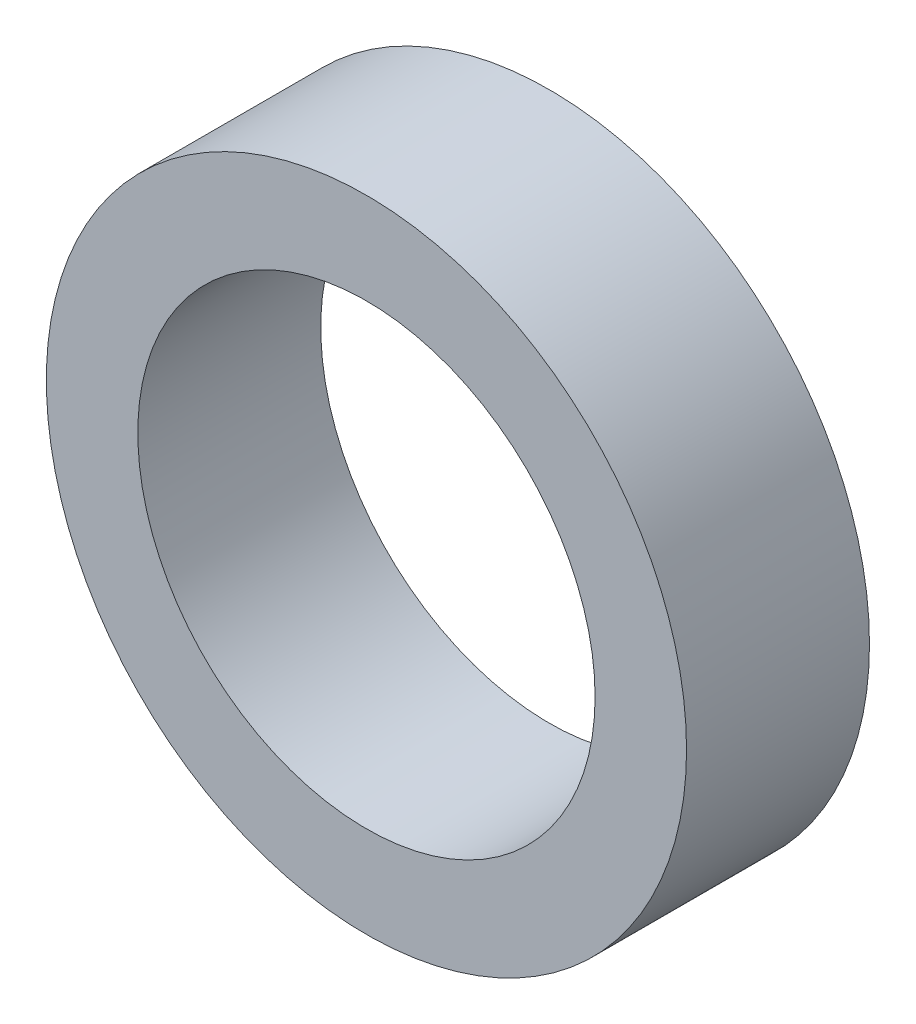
ISO-10303-21;
HEADER;
FILE_DESCRIPTION(('STEP AP214'),'2;1');
FILE_NAME('part.step','',(''),(''),'','','');
FILE_SCHEMA(('AUTOMOTIVE_DESIGN { 1 0 10303 214 1 1 1 1 }'));
ENDSEC;
DATA;
#1=APPLICATION_CONTEXT('core data for automotive mechanical design processes');
#2=APPLICATION_PROTOCOL_DEFINITION('international standard','automotive_design',2000,#1);
#3=PRODUCT_CONTEXT('',#1,'mechanical');
#4=PRODUCT('Part','Part','',(#3));
#5=PRODUCT_RELATED_PRODUCT_CATEGORY('part','',(#4));
#6=PRODUCT_DEFINITION_FORMATION('','',#4);
#7=PRODUCT_DEFINITION_CONTEXT('part definition',#1,'design');
#8=PRODUCT_DEFINITION('design','',#6,#7);
#9=PRODUCT_DEFINITION_SHAPE('','',#8);
#10=(LENGTH_UNIT() NAMED_UNIT(*) SI_UNIT(.MILLI.,.METRE.));
#11=(NAMED_UNIT(*) PLANE_ANGLE_UNIT() SI_UNIT($,.RADIAN.));
#12=(NAMED_UNIT(*) SI_UNIT($,.STERADIAN.) SOLID_ANGLE_UNIT());
#13=UNCERTAINTY_MEASURE_WITH_UNIT(LENGTH_MEASURE(1.E-05),#10,'distance_accuracy_value','');
#14=(GEOMETRIC_REPRESENTATION_CONTEXT(3) GLOBAL_UNCERTAINTY_ASSIGNED_CONTEXT((#13)) GLOBAL_UNIT_ASSIGNED_CONTEXT((#10,
#11,#12)) REPRESENTATION_CONTEXT('',''));
#15=CARTESIAN_POINT('',(0.,0.,0.));
#16=DIRECTION('',(0.,0.,1.));
#17=DIRECTION('',(1.,0.,0.));
#18=AXIS2_PLACEMENT_3D('',#15,#16,#17);
#19=CARTESIAN_POINT('',(0.,0.,4.));
#20=DIRECTION('',(0.,0.,-1.));
#21=DIRECTION('',(0.,1.,0.));
#22=AXIS2_PLACEMENT_3D('',#19,#20,#21);
#23=CYLINDRICAL_SURFACE('',#22,5.);
#24=CARTESIAN_POINT('',(0.,0.,4.));
#25=DIRECTION('',(0.,0.,-1.));
#26=DIRECTION('',(1.,0.,0.));
#27=AXIS2_PLACEMENT_3D('',#24,#25,#26);
#28=CIRCLE('',#27,5.);
#29=CARTESIAN_POINT('',(5.,0.,4.));
#30=VERTEX_POINT('',#29);
#31=EDGE_CURVE('E8',#30,#30,#28,.T.);
#32=ORIENTED_EDGE('',*,*,#31,.F.);
#33=EDGE_LOOP('',(#32));
#34=FACE_BOUND('',#33,.T.);
#35=CARTESIAN_POINT('',(0.,0.,0.));
#36=DIRECTION('',(0.,0.,-1.));
#37=DIRECTION('',(1.,0.,0.));
#38=AXIS2_PLACEMENT_3D('',#35,#36,#37);
#39=CIRCLE('',#38,5.);
#40=CARTESIAN_POINT('',(5.,0.,0.));
#41=VERTEX_POINT('',#40);
#42=EDGE_CURVE('E23',#41,#41,#39,.T.);
#43=ORIENTED_EDGE('',*,*,#42,.T.);
#44=EDGE_LOOP('',(#43));
#45=FACE_BOUND('',#44,.T.);
#46=ADVANCED_FACE('F12',(#34,#45),#23,.F.);
#47=CARTESIAN_POINT('',(0.,0.,4.));
#48=DIRECTION('',(0.,0.,-1.));
#49=DIRECTION('',(0.,1.,0.));
#50=AXIS2_PLACEMENT_3D('',#47,#48,#49);
#51=CYLINDRICAL_SURFACE('',#50,7.);
#52=CARTESIAN_POINT('',(0.,0.,4.));
#53=DIRECTION('',(0.,0.,-1.));
#54=DIRECTION('',(1.,0.,0.));
#55=AXIS2_PLACEMENT_3D('',#52,#53,#54);
#56=CIRCLE('',#55,7.);
#57=CARTESIAN_POINT('',(7.,0.,4.));
#58=VERTEX_POINT('',#57);
#59=EDGE_CURVE('E19',#58,#58,#56,.T.);
#60=ORIENTED_EDGE('',*,*,#59,.T.);
#61=EDGE_LOOP('',(#60));
#62=FACE_BOUND('',#61,.T.);
#63=CARTESIAN_POINT('',(0.,0.,0.));
#64=DIRECTION('',(0.,0.,-1.));
#65=DIRECTION('',(1.,0.,0.));
#66=AXIS2_PLACEMENT_3D('',#63,#64,#65);
#67=CIRCLE('',#66,7.);
#68=CARTESIAN_POINT('',(7.,0.,0.));
#69=VERTEX_POINT('',#68);
#70=EDGE_CURVE('E28',#69,#69,#67,.T.);
#71=ORIENTED_EDGE('',*,*,#70,.F.);
#72=EDGE_LOOP('',(#71));
#73=FACE_BOUND('',#72,.T.);
#74=ADVANCED_FACE('F14',(#62,#73),#51,.T.);
#75=CARTESIAN_POINT('',(0.,0.,4.));
#76=DIRECTION('',(0.,0.,-1.));
#77=DIRECTION('',(0.,1.,0.));
#78=AXIS2_PLACEMENT_3D('',#75,#76,#77);
#79=PLANE('',#78);
#80=ORIENTED_EDGE('',*,*,#31,.T.);
#81=EDGE_LOOP('',(#80));
#82=FACE_BOUND('',#81,.T.);
#83=ORIENTED_EDGE('',*,*,#59,.F.);
#84=EDGE_LOOP('',(#83));
#85=FACE_BOUND('',#84,.T.);
#86=ADVANCED_FACE('F40',(#82,#85),#79,.F.);
#87=CARTESIAN_POINT('',(0.,0.,0.));
#88=DIRECTION('',(0.,0.,-1.));
#89=DIRECTION('',(0.,1.,0.));
#90=AXIS2_PLACEMENT_3D('',#87,#88,#89);
#91=PLANE('',#90);
#92=ORIENTED_EDGE('',*,*,#42,.F.);
#93=EDGE_LOOP('',(#92));
#94=FACE_BOUND('',#93,.T.);
#95=ORIENTED_EDGE('',*,*,#70,.T.);
#96=EDGE_LOOP('',(#95));
#97=FACE_BOUND('',#96,.T.);
#98=ADVANCED_FACE('F37',(#94,#97),#91,.T.);
#99=CLOSED_SHELL('',(#46,#74,#86,#98));
#100=MANIFOLD_SOLID_BREP('B1',#99);
#101=ADVANCED_BREP_SHAPE_REPRESENTATION('',(#18,#100),#14);
#102=SHAPE_DEFINITION_REPRESENTATION(#9,#101);
ENDSEC;
END-ISO-10303-21;
